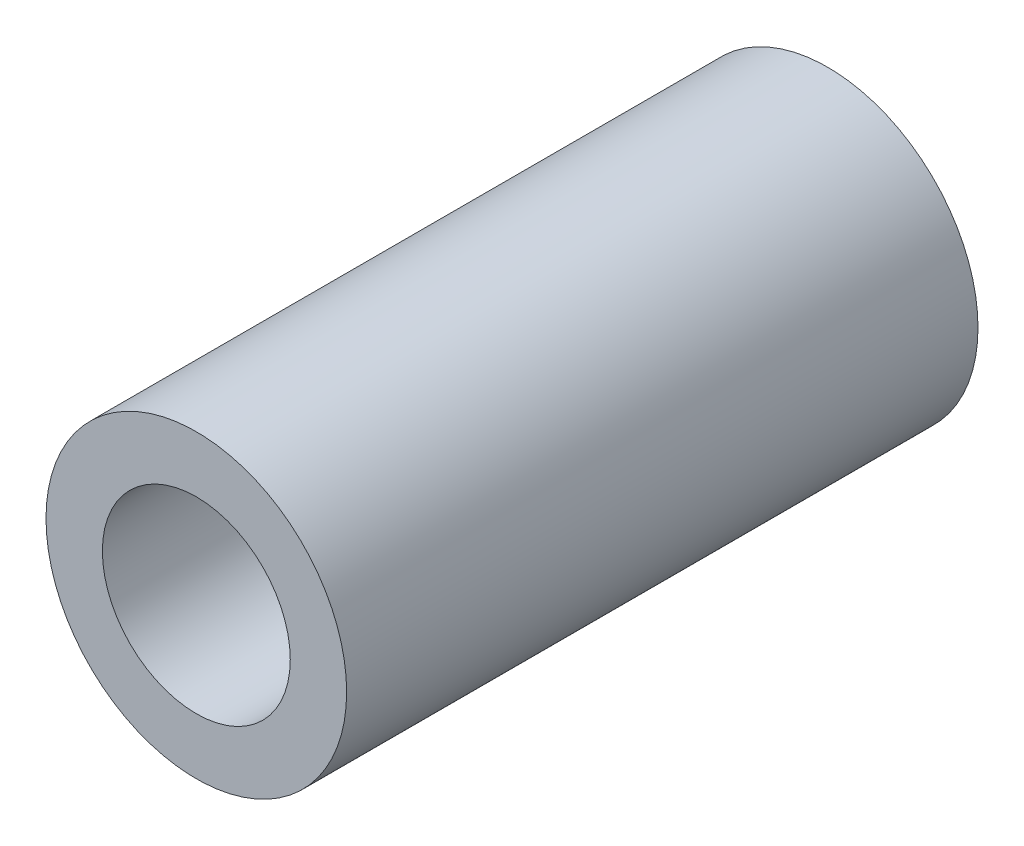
ISO-10303-21;
HEADER;
FILE_DESCRIPTION(('STEP AP214'),'2;1');
FILE_NAME('part.step','',(''),(''),'','','');
FILE_SCHEMA(('AUTOMOTIVE_DESIGN { 1 0 10303 214 1 1 1 1 }'));
ENDSEC;
DATA;
#1=APPLICATION_CONTEXT('core data for automotive mechanical design processes');
#2=APPLICATION_PROTOCOL_DEFINITION('international standard','automotive_design',2000,#1);
#3=PRODUCT_CONTEXT('',#1,'mechanical');
#4=PRODUCT('Part','Part','',(#3));
#5=PRODUCT_RELATED_PRODUCT_CATEGORY('part','',(#4));
#6=PRODUCT_DEFINITION_FORMATION('','',#4);
#7=PRODUCT_DEFINITION_CONTEXT('part definition',#1,'design');
#8=PRODUCT_DEFINITION('design','',#6,#7);
#9=PRODUCT_DEFINITION_SHAPE('','',#8);
#10=(LENGTH_UNIT() NAMED_UNIT(*) SI_UNIT(.MILLI.,.METRE.));
#11=(NAMED_UNIT(*) PLANE_ANGLE_UNIT() SI_UNIT($,.RADIAN.));
#12=(NAMED_UNIT(*) SI_UNIT($,.STERADIAN.) SOLID_ANGLE_UNIT());
#13=UNCERTAINTY_MEASURE_WITH_UNIT(LENGTH_MEASURE(1.E-05),#10,'distance_accuracy_value','');
#14=(GEOMETRIC_REPRESENTATION_CONTEXT(3) GLOBAL_UNCERTAINTY_ASSIGNED_CONTEXT((#13)) GLOBAL_UNIT_ASSIGNED_CONTEXT((#10,
#11,#12)) REPRESENTATION_CONTEXT('',''));
#15=CARTESIAN_POINT('',(0.,0.,0.));
#16=DIRECTION('',(0.,0.,1.));
#17=DIRECTION('',(1.,0.,0.));
#18=AXIS2_PLACEMENT_3D('',#15,#16,#17);
#19=CARTESIAN_POINT('',(0.,0.,42.));
#20=DIRECTION('',(0.,0.,1.));
#21=DIRECTION('',(1.,0.,0.));
#22=AXIS2_PLACEMENT_3D('',#19,#20,#21);
#23=PLANE('',#22);
#24=CARTESIAN_POINT('',(0.,0.,42.));
#25=DIRECTION('',(0.,0.,1.));
#26=DIRECTION('',(1.,0.,0.));
#27=AXIS2_PLACEMENT_3D('',#24,#25,#26);
#28=CIRCLE('',#27,10.);
#29=CARTESIAN_POINT('',(-10.,0.,42.));
#30=VERTEX_POINT('',#29);
#31=EDGE_CURVE('E10',#30,#30,#28,.T.);
#32=ORIENTED_EDGE('',*,*,#31,.T.);
#33=EDGE_LOOP('',(#32));
#34=FACE_BOUND('',#33,.T.);
#35=CARTESIAN_POINT('',(0.,0.,42.));
#36=DIRECTION('',(0.,0.,1.));
#37=DIRECTION('',(1.,0.,0.));
#38=AXIS2_PLACEMENT_3D('',#35,#36,#37);
#39=CIRCLE('',#38,6.25);
#40=CARTESIAN_POINT('',(-6.25,0.,42.));
#41=VERTEX_POINT('',#40);
#42=EDGE_CURVE('E41',#41,#41,#39,.T.);
#43=ORIENTED_EDGE('',*,*,#42,.F.);
#44=EDGE_LOOP('',(#43));
#45=FACE_BOUND('',#44,.T.);
#46=ADVANCED_FACE('F30',(#34,#45),#23,.T.);
#47=CARTESIAN_POINT('',(0.,0.,0.));
#48=DIRECTION('',(0.,0.,1.));
#49=DIRECTION('',(1.,0.,0.));
#50=AXIS2_PLACEMENT_3D('',#47,#48,#49);
#51=PLANE('',#50);
#52=CARTESIAN_POINT('',(0.,0.,0.));
#53=DIRECTION('',(0.,0.,1.));
#54=DIRECTION('',(1.,0.,0.));
#55=AXIS2_PLACEMENT_3D('',#52,#53,#54);
#56=CIRCLE('',#55,10.);
#57=CARTESIAN_POINT('',(-10.,0.,0.));
#58=VERTEX_POINT('',#57);
#59=EDGE_CURVE('E34',#58,#58,#56,.T.);
#60=ORIENTED_EDGE('',*,*,#59,.F.);
#61=EDGE_LOOP('',(#60));
#62=FACE_BOUND('',#61,.T.);
#63=CARTESIAN_POINT('',(0.,0.,0.));
#64=DIRECTION('',(0.,0.,1.));
#65=DIRECTION('',(1.,0.,0.));
#66=AXIS2_PLACEMENT_3D('',#63,#64,#65);
#67=CIRCLE('',#66,6.25);
#68=CARTESIAN_POINT('',(-6.25,0.,0.));
#69=VERTEX_POINT('',#68);
#70=EDGE_CURVE('E43',#69,#69,#67,.T.);
#71=ORIENTED_EDGE('',*,*,#70,.T.);
#72=EDGE_LOOP('',(#71));
#73=FACE_BOUND('',#72,.T.);
#74=ADVANCED_FACE('F53',(#62,#73),#51,.F.);
#75=CARTESIAN_POINT('',(0.,0.,42.));
#76=DIRECTION('',(0.,0.,-1.));
#77=DIRECTION('',(-1.,0.,0.));
#78=AXIS2_PLACEMENT_3D('',#75,#76,#77);
#79=CYLINDRICAL_SURFACE('',#78,10.);
#80=CARTESIAN_POINT('',(-10.,0.,42.));
#81=CARTESIAN_POINT('',(-10.,0.,41.5625));
#82=CARTESIAN_POINT('',(-10.,0.,41.125));
#83=CARTESIAN_POINT('',(-10.,0.,40.25));
#84=CARTESIAN_POINT('',(-10.,0.,39.8125));
#85=CARTESIAN_POINT('',(-10.,0.,38.9375));
#86=CARTESIAN_POINT('',(-10.,0.,38.5));
#87=CARTESIAN_POINT('',(-10.,0.,37.625));
#88=CARTESIAN_POINT('',(-10.,0.,37.1875));
#89=CARTESIAN_POINT('',(-10.,0.,36.3125));
#90=CARTESIAN_POINT('',(-10.,0.,35.875));
#91=CARTESIAN_POINT('',(-10.,0.,35.));
#92=CARTESIAN_POINT('',(-10.,0.,34.5625));
#93=CARTESIAN_POINT('',(-10.,0.,33.6875));
#94=CARTESIAN_POINT('',(-10.,0.,33.25));
#95=CARTESIAN_POINT('',(-10.,0.,32.375));
#96=CARTESIAN_POINT('',(-10.,0.,31.9375));
#97=CARTESIAN_POINT('',(-10.,0.,31.0625));
#98=CARTESIAN_POINT('',(-10.,0.,30.625));
#99=CARTESIAN_POINT('',(-10.,0.,29.75));
#100=CARTESIAN_POINT('',(-10.,0.,29.3125));
#101=CARTESIAN_POINT('',(-10.,0.,28.4375));
#102=CARTESIAN_POINT('',(-10.,0.,28.));
#103=CARTESIAN_POINT('',(-10.,0.,27.125));
#104=CARTESIAN_POINT('',(-10.,0.,26.6875));
#105=CARTESIAN_POINT('',(-10.,0.,25.8125));
#106=CARTESIAN_POINT('',(-10.,0.,25.375));
#107=CARTESIAN_POINT('',(-10.,0.,24.5));
#108=CARTESIAN_POINT('',(-10.,0.,24.0625));
#109=CARTESIAN_POINT('',(-10.,0.,23.1875));
#110=CARTESIAN_POINT('',(-10.,0.,22.75));
#111=CARTESIAN_POINT('',(-10.,0.,21.875));
#112=CARTESIAN_POINT('',(-10.,0.,21.4375));
#113=CARTESIAN_POINT('',(-10.,0.,20.5625));
#114=CARTESIAN_POINT('',(-10.,0.,20.125));
#115=CARTESIAN_POINT('',(-10.,0.,19.25));
#116=CARTESIAN_POINT('',(-10.,0.,18.8125));
#117=CARTESIAN_POINT('',(-10.,0.,17.9375));
#118=CARTESIAN_POINT('',(-10.,0.,17.5));
#119=CARTESIAN_POINT('',(-10.,0.,16.625));
#120=CARTESIAN_POINT('',(-10.,0.,16.1875));
#121=CARTESIAN_POINT('',(-10.,0.,15.3125));
#122=CARTESIAN_POINT('',(-10.,0.,14.875));
#123=CARTESIAN_POINT('',(-10.,0.,14.));
#124=CARTESIAN_POINT('',(-10.,0.,13.5625));
#125=CARTESIAN_POINT('',(-10.,0.,12.6875));
#126=CARTESIAN_POINT('',(-10.,0.,12.25));
#127=CARTESIAN_POINT('',(-10.,0.,11.375));
#128=CARTESIAN_POINT('',(-10.,0.,10.9375));
#129=CARTESIAN_POINT('',(-10.,0.,10.0625));
#130=CARTESIAN_POINT('',(-10.,0.,9.625));
#131=CARTESIAN_POINT('',(-10.,0.,8.75));
#132=CARTESIAN_POINT('',(-10.,0.,8.3125));
#133=CARTESIAN_POINT('',(-10.,0.,7.4375));
#134=CARTESIAN_POINT('',(-10.,0.,7.));
#135=CARTESIAN_POINT('',(-10.,0.,6.125));
#136=CARTESIAN_POINT('',(-10.,0.,5.6875));
#137=CARTESIAN_POINT('',(-10.,0.,4.8125));
#138=CARTESIAN_POINT('',(-10.,0.,4.375));
#139=CARTESIAN_POINT('',(-10.,0.,3.5));
#140=CARTESIAN_POINT('',(-10.,0.,3.0625));
#141=CARTESIAN_POINT('',(-10.,0.,2.1875));
#142=CARTESIAN_POINT('',(-10.,0.,1.75));
#143=CARTESIAN_POINT('',(-10.,0.,0.875000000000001));
#144=CARTESIAN_POINT('',(-10.,0.,0.4375));
#145=CARTESIAN_POINT('',(-10.,0.,0.));
#146=B_SPLINE_CURVE_WITH_KNOTS('',3,(#80,#81,#82,#83,#84,#85,#86,#87,#88,#89,#90,#91,#92,#93,
#94,#95,#96,#97,#98,#99,#100,#101,#102,#103,#104,#105,#106,#107,#108,#109,#110,#111,#112,#113,
#114,#115,#116,#117,#118,#119,#120,#121,#122,#123,#124,#125,#126,#127,#128,#129,#130,#131,#132,
#133,#134,#135,#136,#137,#138,#139,#140,#141,#142,#143,#144,#145),.UNSPECIFIED.,.F.,.F.,(4,2,2,
2,2,2,2,2,2,2,2,2,2,2,2,2,2,2,2,2,2,2,2,2,2,2,2,2,2,2,2,2,4),(0.,1.3125,2.625,3.9375,5.25,
6.56250000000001,7.875,9.1875,10.5,11.8125,13.125,14.4375,15.75,17.0625,18.375,19.6875,21.,
22.3125,23.625,24.9375,26.25,27.5625,28.875,30.1875,31.5,32.8125,34.125,35.4375,36.75,38.0625,
39.375,40.6875,42.),.UNSPECIFIED.);
#147=EDGE_CURVE('BSEAM32',#30,#58,#146,.T.);
#148=ORIENTED_EDGE('',*,*,#31,.F.);
#149=ORIENTED_EDGE('',*,*,#59,.T.);
#150=ORIENTED_EDGE('',*,*,#147,.T.);
#151=ORIENTED_EDGE('',*,*,#147,.F.);
#152=EDGE_LOOP('',(#148,#150,#149,#151));
#153=FACE_BOUND('',#152,.T.);
#154=ADVANCED_FACE('F32',(#153),#79,.T.);
#155=CARTESIAN_POINT('',(0.,0.,42.));
#156=DIRECTION('',(0.,0.,-1.));
#157=DIRECTION('',(-1.,0.,0.));
#158=AXIS2_PLACEMENT_3D('',#155,#156,#157);
#159=CYLINDRICAL_SURFACE('',#158,6.25);
#160=CARTESIAN_POINT('',(-6.25,0.,42.));
#161=CARTESIAN_POINT('',(-6.25,0.,41.5625));
#162=CARTESIAN_POINT('',(-6.25,0.,41.125));
#163=CARTESIAN_POINT('',(-6.25,0.,40.25));
#164=CARTESIAN_POINT('',(-6.25,0.,39.8125));
#165=CARTESIAN_POINT('',(-6.25,0.,38.9375));
#166=CARTESIAN_POINT('',(-6.25,0.,38.5));
#167=CARTESIAN_POINT('',(-6.25,0.,37.625));
#168=CARTESIAN_POINT('',(-6.25,0.,37.1875));
#169=CARTESIAN_POINT('',(-6.25,0.,36.3125));
#170=CARTESIAN_POINT('',(-6.25,0.,35.875));
#171=CARTESIAN_POINT('',(-6.25,0.,35.));
#172=CARTESIAN_POINT('',(-6.25,0.,34.5625));
#173=CARTESIAN_POINT('',(-6.25,0.,33.6875));
#174=CARTESIAN_POINT('',(-6.25,0.,33.25));
#175=CARTESIAN_POINT('',(-6.25,0.,32.375));
#176=CARTESIAN_POINT('',(-6.25,0.,31.9375));
#177=CARTESIAN_POINT('',(-6.25,0.,31.0625));
#178=CARTESIAN_POINT('',(-6.25,0.,30.625));
#179=CARTESIAN_POINT('',(-6.25,0.,29.75));
#180=CARTESIAN_POINT('',(-6.25,0.,29.3125));
#181=CARTESIAN_POINT('',(-6.25,0.,28.4375));
#182=CARTESIAN_POINT('',(-6.25,0.,28.));
#183=CARTESIAN_POINT('',(-6.25,0.,27.125));
#184=CARTESIAN_POINT('',(-6.25,0.,26.6875));
#185=CARTESIAN_POINT('',(-6.25,0.,25.8125));
#186=CARTESIAN_POINT('',(-6.25,0.,25.375));
#187=CARTESIAN_POINT('',(-6.25,0.,24.5));
#188=CARTESIAN_POINT('',(-6.25,0.,24.0625));
#189=CARTESIAN_POINT('',(-6.25,0.,23.1875));
#190=CARTESIAN_POINT('',(-6.25,0.,22.75));
#191=CARTESIAN_POINT('',(-6.25,0.,21.875));
#192=CARTESIAN_POINT('',(-6.25,0.,21.4375));
#193=CARTESIAN_POINT('',(-6.25,0.,20.5625));
#194=CARTESIAN_POINT('',(-6.25,0.,20.125));
#195=CARTESIAN_POINT('',(-6.25,0.,19.25));
#196=CARTESIAN_POINT('',(-6.25,0.,18.8125));
#197=CARTESIAN_POINT('',(-6.25,0.,17.9375));
#198=CARTESIAN_POINT('',(-6.25,0.,17.5));
#199=CARTESIAN_POINT('',(-6.25,0.,16.625));
#200=CARTESIAN_POINT('',(-6.25,0.,16.1875));
#201=CARTESIAN_POINT('',(-6.25,0.,15.3125));
#202=CARTESIAN_POINT('',(-6.25,0.,14.875));
#203=CARTESIAN_POINT('',(-6.25,0.,14.));
#204=CARTESIAN_POINT('',(-6.25,0.,13.5625));
#205=CARTESIAN_POINT('',(-6.25,0.,12.6875));
#206=CARTESIAN_POINT('',(-6.25,0.,12.25));
#207=CARTESIAN_POINT('',(-6.25,0.,11.375));
#208=CARTESIAN_POINT('',(-6.25,0.,10.9375));
#209=CARTESIAN_POINT('',(-6.25,0.,10.0625));
#210=CARTESIAN_POINT('',(-6.25,0.,9.625));
#211=CARTESIAN_POINT('',(-6.25,0.,8.75));
#212=CARTESIAN_POINT('',(-6.25,0.,8.3125));
#213=CARTESIAN_POINT('',(-6.25,0.,7.4375));
#214=CARTESIAN_POINT('',(-6.25,0.,7.));
#215=CARTESIAN_POINT('',(-6.25,0.,6.125));
#216=CARTESIAN_POINT('',(-6.25,0.,5.6875));
#217=CARTESIAN_POINT('',(-6.25,0.,4.8125));
#218=CARTESIAN_POINT('',(-6.25,0.,4.375));
#219=CARTESIAN_POINT('',(-6.25,0.,3.5));
#220=CARTESIAN_POINT('',(-6.25,0.,3.0625));
#221=CARTESIAN_POINT('',(-6.25,0.,2.1875));
#222=CARTESIAN_POINT('',(-6.25,0.,1.75));
#223=CARTESIAN_POINT('',(-6.25,0.,0.875000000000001));
#224=CARTESIAN_POINT('',(-6.25,0.,0.4375));
#225=CARTESIAN_POINT('',(-6.25,0.,0.));
#226=B_SPLINE_CURVE_WITH_KNOTS('',3,(#160,#161,#162,#163,#164,#165,#166,#167,#168,#169,#170,
#171,#172,#173,#174,#175,#176,#177,#178,#179,#180,#181,#182,#183,#184,#185,#186,#187,#188,#189,
#190,#191,#192,#193,#194,#195,#196,#197,#198,#199,#200,#201,#202,#203,#204,#205,#206,#207,#208,
#209,#210,#211,#212,#213,#214,#215,#216,#217,#218,#219,#220,#221,#222,#223,#224,#225),
.UNSPECIFIED.,.F.,.F.,(4,2,2,2,2,2,2,2,2,2,2,2,2,2,2,2,2,2,2,2,2,2,2,2,2,2,2,2,2,2,2,2,4),(0.,
1.31249999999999,2.625,3.9375,5.25,6.5625,7.87499999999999,9.18749999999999,10.5,11.8125,13.125,
14.4375,15.75,17.0625,18.375,19.6875,21.,22.3125,23.625,24.9375,26.25,27.5625,28.875,30.1875,
31.5,32.8125,34.125,35.4375,36.75,38.0625,39.375,40.6875,42.),.UNSPECIFIED.);
#227=EDGE_CURVE('BSEAM49',#41,#69,#226,.T.);
#228=ORIENTED_EDGE('',*,*,#42,.T.);
#229=ORIENTED_EDGE('',*,*,#70,.F.);
#230=ORIENTED_EDGE('',*,*,#227,.T.);
#231=ORIENTED_EDGE('',*,*,#227,.F.);
#232=EDGE_LOOP('',(#228,#230,#229,#231));
#233=FACE_BOUND('',#232,.T.);
#234=ADVANCED_FACE('F49',(#233),#159,.F.);
#235=CLOSED_SHELL('',(#46,#74,#154,#234));
#236=MANIFOLD_SOLID_BREP('B2',#235);
#237=ADVANCED_BREP_SHAPE_REPRESENTATION('',(#18,#236),#14);
#238=SHAPE_DEFINITION_REPRESENTATION(#9,#237);
ENDSEC;
END-ISO-10303-21;
